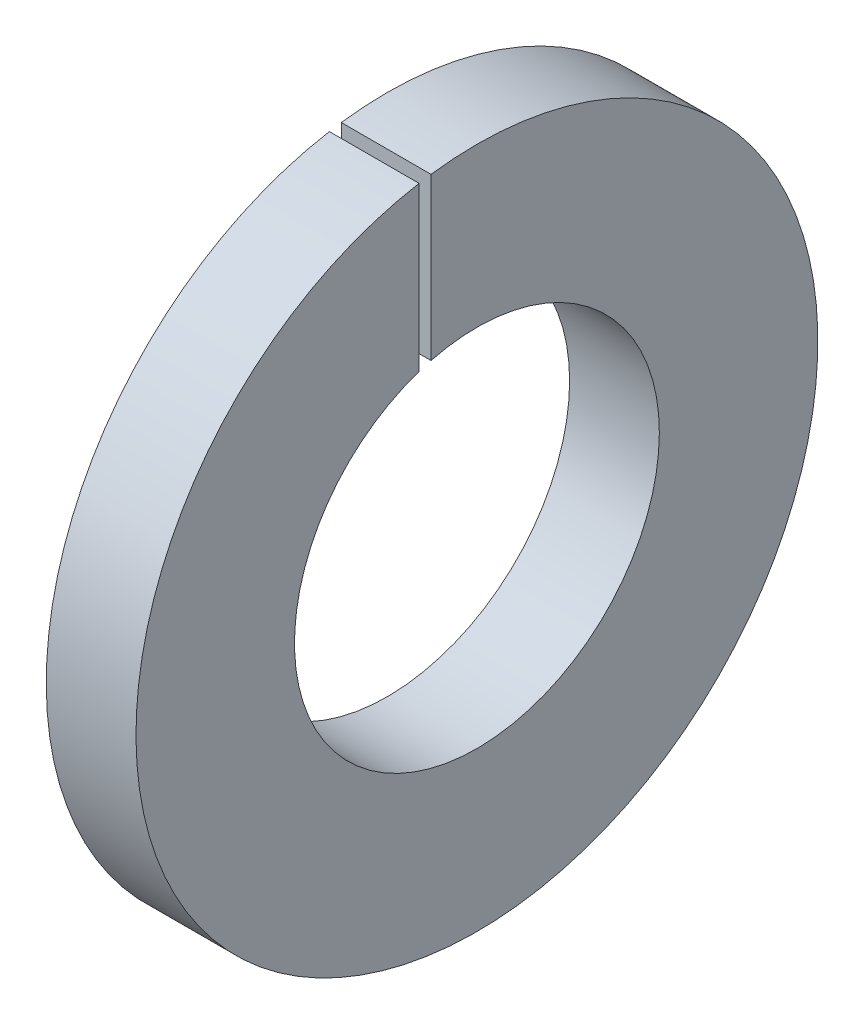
from build123d import *

# Parameters (mm, degrees)
ESQUISSE1_W             = 1.5
ESQUISSE1_H             = 2.65
ENL_V_MAT_EXTRU_1_DEPTH = 9.199390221


with BuildPart() as part:
    # Esquisse1 → R_volution1 (revolve)
    with BuildSketch(Plane.XY, mode=Mode.PRIVATE) as r_volution1_sk:
        with Locations((0.75, 4.375)):
            Rectangle(ESQUISSE1_W, ESQUISSE1_H)
    revolve(r_volution1_sk.sketch.rotate(Axis((-42.855260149, 0, 0), (1, 0, 0)), 90), axis=Axis((-42.855260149, 0, 0), (1, 0, 0)))

    # Esquisse2 → Enl_v. mat.-Extru.1 (cut, through all)
    with BuildSketch(Plane(origin=(1.5, 0, 0), x_dir=(0, 0, -1), z_dir=(1, 0, 0))):
        with BuildLine():
            Line((-0.76701399, 5.648158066), (-0.76701399, 2.951980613))
            ThreePointArc((-0.76701399, 2.951980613), (-0.867521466, 2.924022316), (-0.96701399, 2.892643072))
            Line((-0.96701399, 2.892643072), (-0.96701399, 5.617373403))
            ThreePointArc((-0.96701399, 5.617373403), (-0.867150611, 5.633653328), (-0.76701399, 5.648158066))
        make_face()
    extrude(amount=-ENL_V_MAT_EXTRU_1_DEPTH, mode=Mode.SUBTRACT)


solid = part.part
